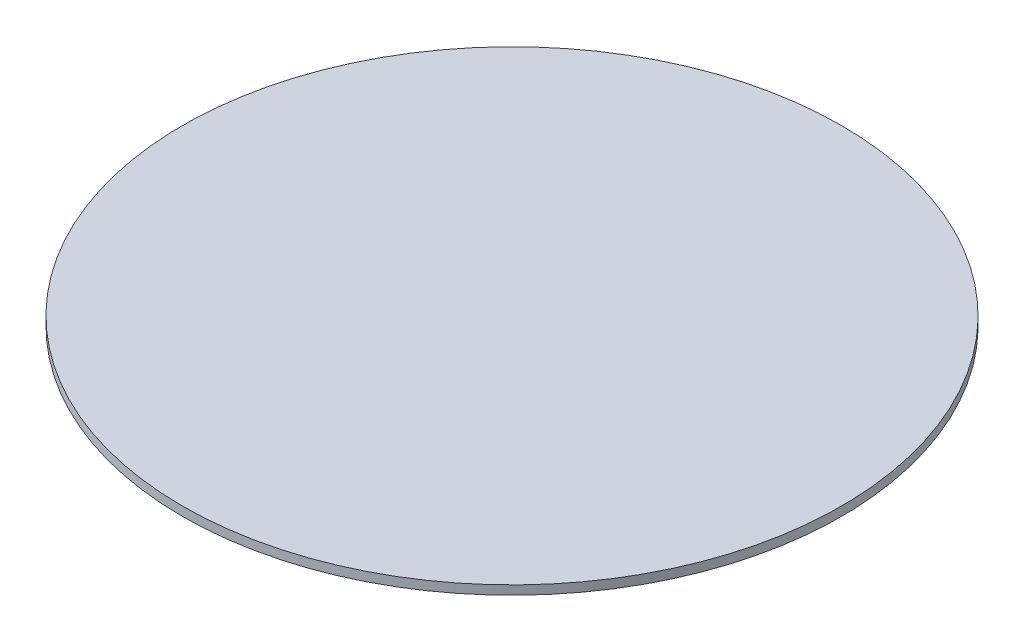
from build123d import *

# Parameters (mm, degrees)
CROQUIS1_R              = 110
SALIENTE_EXTRUIR1_DEPTH = 3
CROQUIS2_R              = 11
SALIENTE_EXTRUIR2_DEPTH = 15
SALIENTE_EXTRUIR2_TAPER = 5
REDONDEO1_R             = 1
MATRIZC1_COUNT          = 4


with BuildPart() as part:
    # Croquis1 → Saliente-Extruir1 (new body)
    with BuildSketch(Plane(origin=(0, 0, 0), x_dir=(1, 0, 0), z_dir=(0, 1, 0))):
        with Locations(Location((0, 0, 0), (0, 0, 270))):
            Circle(CROQUIS1_R)
    extrude(amount=SALIENTE_EXTRUIR1_DEPTH)


with BuildPart() as body_2:
    # Croquis2 → Saliente-Extruir2 (new body)
    with BuildSketch(Plane.XZ):
        with Locations((80, 0)):
            Circle(CROQUIS2_R)
    extrude(amount=SALIENTE_EXTRUIR2_DEPTH, taper=SALIENTE_EXTRUIR2_TAPER)

    # Redondeo1
    redondeo1_edges = [body_2.edges().sort_by_distance(p)[0] for p in [
        (70.312329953, -15, 0),
    ]]
    fillet(redondeo1_edges, radius=REDONDEO1_R)


with BuildPart() as matrizc1_1:
    # MatrizC1: pattern copy
    add(body_2.part.rotate(Axis((0, 0, 0), (0, 1, 0)), 1 * 360 / MATRIZC1_COUNT))


with BuildPart() as matrizc1_2:
    # MatrizC1: pattern copy
    add(body_2.part.rotate(Axis((0, 0, 0), (0, 1, 0)), 2 * 360 / MATRIZC1_COUNT))


with BuildPart() as matrizc1_3:
    # MatrizC1: pattern copy
    add(body_2.part.rotate(Axis((0, 0, 0), (0, 1, 0)), 3 * 360 / MATRIZC1_COUNT))


solid = Compound([part.part, body_2.part, matrizc1_1.part, matrizc1_2.part, matrizc1_3.part])
